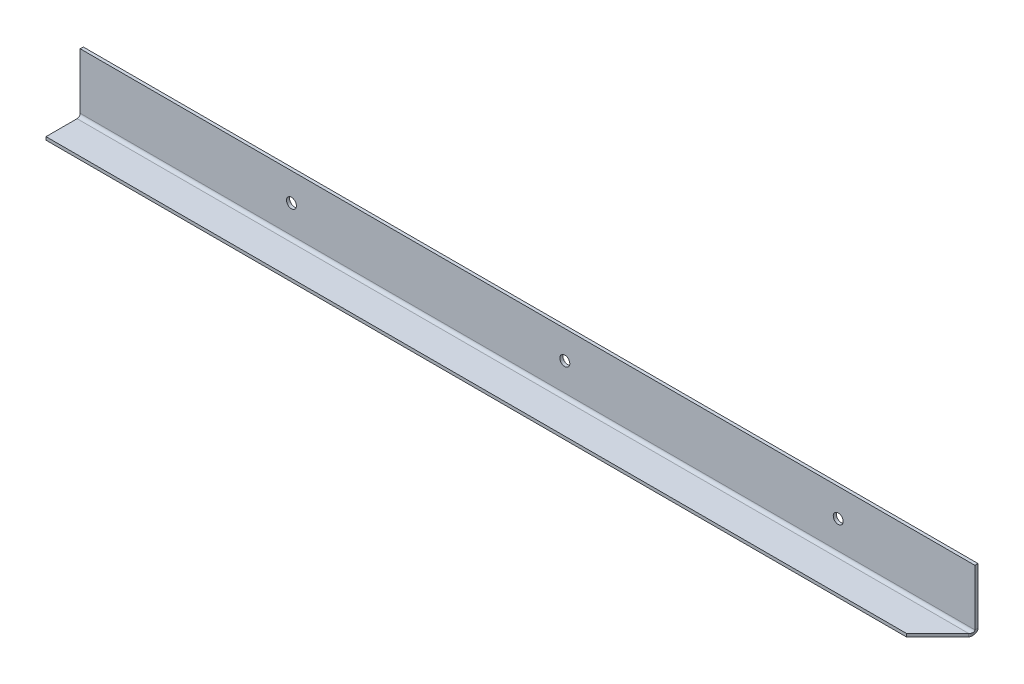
ISO-10303-21;
HEADER;
FILE_DESCRIPTION(('STEP AP214'),'2;1');
FILE_NAME('part.step','',(''),(''),'','','');
FILE_SCHEMA(('AUTOMOTIVE_DESIGN { 1 0 10303 214 1 1 1 1 }'));
ENDSEC;
DATA;
#1=APPLICATION_CONTEXT('core data for automotive mechanical design processes');
#2=APPLICATION_PROTOCOL_DEFINITION('international standard','automotive_design',2000,#1);
#3=PRODUCT_CONTEXT('',#1,'mechanical');
#4=PRODUCT('Part','Part','',(#3));
#5=PRODUCT_RELATED_PRODUCT_CATEGORY('part','',(#4));
#6=PRODUCT_DEFINITION_FORMATION('','',#4);
#7=PRODUCT_DEFINITION_CONTEXT('part definition',#1,'design');
#8=PRODUCT_DEFINITION('design','',#6,#7);
#9=PRODUCT_DEFINITION_SHAPE('','',#8);
#10=(LENGTH_UNIT() NAMED_UNIT(*) SI_UNIT(.MILLI.,.METRE.));
#11=(NAMED_UNIT(*) PLANE_ANGLE_UNIT() SI_UNIT($,.RADIAN.));
#12=(NAMED_UNIT(*) SI_UNIT($,.STERADIAN.) SOLID_ANGLE_UNIT());
#13=UNCERTAINTY_MEASURE_WITH_UNIT(LENGTH_MEASURE(1.E-05),#10,'distance_accuracy_value','');
#14=(GEOMETRIC_REPRESENTATION_CONTEXT(3) GLOBAL_UNCERTAINTY_ASSIGNED_CONTEXT((#13)) GLOBAL_UNIT_ASSIGNED_CONTEXT((#10,
#11,#12)) REPRESENTATION_CONTEXT('',''));
#15=CARTESIAN_POINT('',(0.,0.,0.));
#16=DIRECTION('',(0.,0.,1.));
#17=DIRECTION('',(1.,0.,0.));
#18=AXIS2_PLACEMENT_3D('',#15,#16,#17);
#19=CARTESIAN_POINT('',(495.814044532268,1.5875,0.));
#20=DIRECTION('',(0.,-1.,0.));
#21=DIRECTION('',(0.,0.,-1.));
#22=AXIS2_PLACEMENT_3D('',#19,#20,#21);
#23=PLANE('',#22);
#24=DIRECTION('',(0.707106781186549,0.,-0.707106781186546));
#25=VECTOR('',#24,1.);
#26=CARTESIAN_POINT('',(477.300772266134,1.5875,-18.5132722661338));
#27=LINE('',#26,#25);
#28=CARTESIAN_POINT('',(439.7375,1.58749999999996,19.05));
#29=VERTEX_POINT('',#28);
#30=CARTESIAN_POINT('',(455.6125,1.5875,3.175));
#31=VERTEX_POINT('',#30);
#32=EDGE_CURVE('E129',#29,#31,#27,.T.);
#33=ORIENTED_EDGE('',*,*,#32,.T.);
#34=DIRECTION('',(-1.,0.,0.));
#35=VECTOR('',#34,1.);
#36=CARTESIAN_POINT('',(495.814044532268,1.5875,3.175));
#37=LINE('',#36,#35);
#38=CARTESIAN_POINT('',(0.,1.5875,3.175));
#39=VERTEX_POINT('',#38);
#40=EDGE_CURVE('E74',#31,#39,#37,.T.);
#41=ORIENTED_EDGE('',*,*,#40,.T.);
#42=DIRECTION('',(0.,0.,1.));
#43=VECTOR('',#42,1.);
#44=CARTESIAN_POINT('',(0.,1.5875,0.));
#45=LINE('',#44,#43);
#46=CARTESIAN_POINT('',(0.,1.5875,19.05));
#47=VERTEX_POINT('',#46);
#48=EDGE_CURVE('E138',#39,#47,#45,.T.);
#49=ORIENTED_EDGE('',*,*,#48,.T.);
#50=DIRECTION('',(-1.,0.,0.));
#51=VECTOR('',#50,1.);
#52=CARTESIAN_POINT('',(495.814044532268,1.5875,19.05));
#53=LINE('',#52,#51);
#54=EDGE_CURVE('E160',#29,#47,#53,.T.);
#55=ORIENTED_EDGE('',*,*,#54,.F.);
#56=EDGE_LOOP('',(#33,#41,#49,#55));
#57=FACE_BOUND('',#56,.T.);
#58=ADVANCED_FACE('F48',(#57),#23,.F.);
#59=CARTESIAN_POINT('',(495.814044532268,0.,19.05));
#60=DIRECTION('',(0.,0.,1.));
#61=DIRECTION('',(1.,0.,0.));
#62=AXIS2_PLACEMENT_3D('',#59,#60,#61);
#63=PLANE('',#62);
#64=DIRECTION('',(-1.,0.,0.));
#65=VECTOR('',#64,1.);
#66=CARTESIAN_POINT('',(495.814044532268,0.,19.05));
#67=LINE('',#66,#65);
#68=CARTESIAN_POINT('',(439.7375,0.,19.05));
#69=VERTEX_POINT('',#68);
#70=CARTESIAN_POINT('',(0.,0.,19.05));
#71=VERTEX_POINT('',#70);
#72=EDGE_CURVE('E155',#69,#71,#67,.T.);
#73=ORIENTED_EDGE('',*,*,#72,.F.);
#74=DIRECTION('',(0.,1.,0.));
#75=VECTOR('',#74,1.);
#76=CARTESIAN_POINT('',(439.7375,1.58749999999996,19.05));
#77=LINE('',#76,#75);
#78=EDGE_CURVE('E124',#29,#69,#77,.F.);
#79=ORIENTED_EDGE('',*,*,#78,.F.);
#80=ORIENTED_EDGE('',*,*,#54,.T.);
#81=DIRECTION('',(0.,1.,0.));
#82=VECTOR('',#81,1.);
#83=CARTESIAN_POINT('',(0.,0.,19.05));
#84=LINE('',#83,#82);
#85=EDGE_CURVE('E210',#71,#47,#84,.T.);
#86=ORIENTED_EDGE('',*,*,#85,.F.);
#87=EDGE_LOOP('',(#73,#79,#80,#86));
#88=FACE_BOUND('',#87,.T.);
#89=ADVANCED_FACE('F268',(#88),#63,.T.);
#90=CARTESIAN_POINT('',(495.814044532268,0.,0.));
#91=DIRECTION('',(0.,-1.,0.));
#92=DIRECTION('',(0.,0.,-1.));
#93=AXIS2_PLACEMENT_3D('',#90,#91,#92);
#94=PLANE('',#93);
#95=DIRECTION('',(-1.,0.,0.));
#96=VECTOR('',#95,1.);
#97=CARTESIAN_POINT('',(495.814044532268,0.,3.175));
#98=LINE('',#97,#96);
#99=CARTESIAN_POINT('',(455.6125,0.,3.175));
#100=VERTEX_POINT('',#99);
#101=CARTESIAN_POINT('',(0.,0.,3.175));
#102=VERTEX_POINT('',#101);
#103=EDGE_CURVE('E144',#100,#102,#98,.T.);
#104=ORIENTED_EDGE('',*,*,#103,.F.);
#105=DIRECTION('',(0.707106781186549,0.,-0.707106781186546));
#106=VECTOR('',#105,1.);
#107=CARTESIAN_POINT('',(477.300772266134,0.,-18.5132722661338));
#108=LINE('',#107,#106);
#109=EDGE_CURVE('E118',#69,#100,#108,.T.);
#110=ORIENTED_EDGE('',*,*,#109,.F.);
#111=ORIENTED_EDGE('',*,*,#72,.T.);
#112=DIRECTION('',(0.,0.,1.));
#113=VECTOR('',#112,1.);
#114=CARTESIAN_POINT('',(0.,0.,0.));
#115=LINE('',#114,#113);
#116=EDGE_CURVE('E152',#102,#71,#115,.T.);
#117=ORIENTED_EDGE('',*,*,#116,.F.);
#118=EDGE_LOOP('',(#104,#110,#111,#117));
#119=FACE_BOUND('',#118,.T.);
#120=ADVANCED_FACE('F150',(#119),#94,.T.);
#121=CARTESIAN_POINT('',(495.814044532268,3.175,3.175));
#122=DIRECTION('',(-1.,0.,0.));
#123=DIRECTION('',(0.,0.,1.));
#124=AXIS2_PLACEMENT_3D('',#121,#122,#123);
#125=CYLINDRICAL_SURFACE('',#124,3.175);
#126=DIRECTION('',(-1.,0.,0.));
#127=VECTOR('',#126,1.);
#128=CARTESIAN_POINT('',(495.814044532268,3.175,0.));
#129=LINE('',#128,#127);
#130=CARTESIAN_POINT('',(457.2,3.175,0.));
#131=VERTEX_POINT('',#130);
#132=CARTESIAN_POINT('',(0.,3.175,0.));
#133=VERTEX_POINT('',#132);
#134=EDGE_CURVE('E146',#131,#133,#129,.T.);
#135=ORIENTED_EDGE('',*,*,#134,.F.);
#136=CARTESIAN_POINT('',(455.6125,3.175,3.175));
#137=DIRECTION('',(-0.894427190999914,0.,-0.447213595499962));
#138=DIRECTION('',(-0.447213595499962,0.,0.894427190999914));
#139=AXIS2_PLACEMENT_3D('',#136,#137,#138);
#140=ELLIPSE('',#139,3.54975791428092,3.175);
#141=EDGE_CURVE('E134',#100,#131,#140,.F.);
#142=ORIENTED_EDGE('',*,*,#141,.F.);
#143=ORIENTED_EDGE('',*,*,#103,.T.);
#144=CARTESIAN_POINT('',(0.,3.175,3.175));
#145=DIRECTION('',(1.,0.,0.));
#146=DIRECTION('',(0.,0.,-1.));
#147=AXIS2_PLACEMENT_3D('',#144,#145,#146);
#148=CIRCLE('',#147,3.175);
#149=EDGE_CURVE('E216',#133,#102,#148,.F.);
#150=ORIENTED_EDGE('',*,*,#149,.F.);
#151=EDGE_LOOP('',(#135,#142,#143,#150));
#152=FACE_BOUND('',#151,.T.);
#153=ADVANCED_FACE('F142',(#152),#125,.T.);
#154=CARTESIAN_POINT('',(495.814044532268,0.,0.));
#155=DIRECTION('',(0.,0.,-1.));
#156=DIRECTION('',(-1.,0.,0.));
#157=AXIS2_PLACEMENT_3D('',#154,#155,#156);
#158=PLANE('',#157);
#159=CARTESIAN_POINT('',(387.35,17.4625,0.));
#160=DIRECTION('',(0.,0.,-1.));
#161=DIRECTION('',(-1.,0.,0.));
#162=AXIS2_PLACEMENT_3D('',#159,#160,#161);
#163=CIRCLE('',#162,2.54000000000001);
#164=CARTESIAN_POINT('',(384.81,17.4625,0.));
#165=VERTEX_POINT('',#164);
#166=EDGE_CURVE('E174',#165,#165,#163,.T.);
#167=ORIENTED_EDGE('',*,*,#166,.F.);
#168=EDGE_LOOP('',(#167));
#169=FACE_BOUND('',#168,.T.);
#170=CARTESIAN_POINT('',(247.65,17.4625,0.));
#171=DIRECTION('',(0.,0.,-1.));
#172=DIRECTION('',(-1.,0.,0.));
#173=AXIS2_PLACEMENT_3D('',#170,#171,#172);
#174=CIRCLE('',#173,2.53999999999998);
#175=CARTESIAN_POINT('',(245.11,17.4625,0.));
#176=VERTEX_POINT('',#175);
#177=EDGE_CURVE('E456',#176,#176,#174,.T.);
#178=ORIENTED_EDGE('',*,*,#177,.F.);
#179=EDGE_LOOP('',(#178));
#180=FACE_BOUND('',#179,.T.);
#181=CARTESIAN_POINT('',(107.95,17.4625,0.));
#182=DIRECTION('',(0.,0.,-1.));
#183=DIRECTION('',(-1.,0.,0.));
#184=AXIS2_PLACEMENT_3D('',#181,#182,#183);
#185=CIRCLE('',#184,2.54);
#186=CARTESIAN_POINT('',(105.41,17.4625,0.));
#187=VERTEX_POINT('',#186);
#188=EDGE_CURVE('E461',#187,#187,#185,.T.);
#189=ORIENTED_EDGE('',*,*,#188,.F.);
#190=EDGE_LOOP('',(#189));
#191=FACE_BOUND('',#190,.T.);
#192=DIRECTION('',(-1.,0.,0.));
#193=VECTOR('',#192,1.);
#194=CARTESIAN_POINT('',(495.814044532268,31.75,0.));
#195=LINE('',#194,#193);
#196=CARTESIAN_POINT('',(457.2,31.75,0.));
#197=VERTEX_POINT('',#196);
#198=CARTESIAN_POINT('',(0.,31.75,0.));
#199=VERTEX_POINT('',#198);
#200=EDGE_CURVE('E162',#197,#199,#195,.T.);
#201=ORIENTED_EDGE('',*,*,#200,.F.);
#202=DIRECTION('',(0.,1.,0.));
#203=VECTOR('',#202,1.);
#204=CARTESIAN_POINT('',(457.2,0.,0.));
#205=LINE('',#204,#203);
#206=EDGE_CURVE('E192',#131,#197,#205,.T.);
#207=ORIENTED_EDGE('',*,*,#206,.F.);
#208=ORIENTED_EDGE('',*,*,#134,.T.);
#209=DIRECTION('',(0.,-1.,0.));
#210=VECTOR('',#209,1.);
#211=CARTESIAN_POINT('',(0.,0.,0.));
#212=LINE('',#211,#210);
#213=EDGE_CURVE('E219',#199,#133,#212,.T.);
#214=ORIENTED_EDGE('',*,*,#213,.F.);
#215=EDGE_LOOP('',(#201,#207,#208,#214));
#216=FACE_BOUND('',#215,.T.);
#217=ADVANCED_FACE('F252',(#169,#180,#191,#216),#158,.T.);
#218=CARTESIAN_POINT('',(495.814044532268,31.75,1.5875));
#219=DIRECTION('',(0.,1.,0.));
#220=DIRECTION('',(0.,0.,1.));
#221=AXIS2_PLACEMENT_3D('',#218,#219,#220);
#222=PLANE('',#221);
#223=DIRECTION('',(-1.,0.,0.));
#224=VECTOR('',#223,1.);
#225=CARTESIAN_POINT('',(495.814044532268,31.75,1.5875));
#226=LINE('',#225,#224);
#227=CARTESIAN_POINT('',(457.2,31.75,1.5875));
#228=VERTEX_POINT('',#227);
#229=CARTESIAN_POINT('',(0.,31.75,1.5875));
#230=VERTEX_POINT('',#229);
#231=EDGE_CURVE('E240',#228,#230,#226,.T.);
#232=ORIENTED_EDGE('',*,*,#231,.F.);
#233=DIRECTION('',(0.,0.,1.));
#234=VECTOR('',#233,1.);
#235=CARTESIAN_POINT('',(457.2,31.75,1.5875));
#236=LINE('',#235,#234);
#237=EDGE_CURVE('E198',#228,#197,#236,.F.);
#238=ORIENTED_EDGE('',*,*,#237,.T.);
#239=ORIENTED_EDGE('',*,*,#200,.T.);
#240=DIRECTION('',(0.,0.,-1.));
#241=VECTOR('',#240,1.);
#242=CARTESIAN_POINT('',(0.,31.75,1.5875));
#243=LINE('',#242,#241);
#244=EDGE_CURVE('E223',#230,#199,#243,.T.);
#245=ORIENTED_EDGE('',*,*,#244,.F.);
#246=EDGE_LOOP('',(#232,#238,#239,#245));
#247=FACE_BOUND('',#246,.T.);
#248=ADVANCED_FACE('F249',(#247),#222,.T.);
#249=CARTESIAN_POINT('',(495.814044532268,0.,1.5875));
#250=DIRECTION('',(0.,0.,-1.));
#251=DIRECTION('',(-1.,0.,0.));
#252=AXIS2_PLACEMENT_3D('',#249,#250,#251);
#253=PLANE('',#252);
#254=CARTESIAN_POINT('',(387.35,17.4625,1.5875));
#255=DIRECTION('',(0.,0.,-1.));
#256=DIRECTION('',(-1.,0.,0.));
#257=AXIS2_PLACEMENT_3D('',#254,#255,#256);
#258=CIRCLE('',#257,2.54000000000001);
#259=CARTESIAN_POINT('',(384.81,17.4625,1.5875));
#260=VERTEX_POINT('',#259);
#261=EDGE_CURVE('E52',#260,#260,#258,.T.);
#262=ORIENTED_EDGE('',*,*,#261,.T.);
#263=EDGE_LOOP('',(#262));
#264=FACE_BOUND('',#263,.T.);
#265=CARTESIAN_POINT('',(247.65,17.4625,1.5875));
#266=DIRECTION('',(0.,0.,-1.));
#267=DIRECTION('',(-1.,0.,0.));
#268=AXIS2_PLACEMENT_3D('',#265,#266,#267);
#269=CIRCLE('',#268,2.53999999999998);
#270=CARTESIAN_POINT('',(245.11,17.4625,1.5875));
#271=VERTEX_POINT('',#270);
#272=EDGE_CURVE('E173',#271,#271,#269,.T.);
#273=ORIENTED_EDGE('',*,*,#272,.T.);
#274=EDGE_LOOP('',(#273));
#275=FACE_BOUND('',#274,.T.);
#276=CARTESIAN_POINT('',(107.95,17.4625,1.5875));
#277=DIRECTION('',(0.,0.,-1.));
#278=DIRECTION('',(-1.,0.,0.));
#279=AXIS2_PLACEMENT_3D('',#276,#277,#278);
#280=CIRCLE('',#279,2.54);
#281=CARTESIAN_POINT('',(105.41,17.4625,1.5875));
#282=VERTEX_POINT('',#281);
#283=EDGE_CURVE('E170',#282,#282,#280,.T.);
#284=ORIENTED_EDGE('',*,*,#283,.T.);
#285=EDGE_LOOP('',(#284));
#286=FACE_BOUND('',#285,.T.);
#287=DIRECTION('',(0.,1.,0.));
#288=VECTOR('',#287,1.);
#289=CARTESIAN_POINT('',(457.2,0.,1.5875));
#290=LINE('',#289,#288);
#291=CARTESIAN_POINT('',(457.2,3.175,1.5875));
#292=VERTEX_POINT('',#291);
#293=EDGE_CURVE('E66',#292,#228,#290,.T.);
#294=ORIENTED_EDGE('',*,*,#293,.T.);
#295=ORIENTED_EDGE('',*,*,#231,.T.);
#296=DIRECTION('',(0.,1.,0.));
#297=VECTOR('',#296,1.);
#298=CARTESIAN_POINT('',(0.,0.,1.5875));
#299=LINE('',#298,#297);
#300=CARTESIAN_POINT('',(0.,3.175,1.5875));
#301=VERTEX_POINT('',#300);
#302=EDGE_CURVE('E227',#230,#301,#299,.F.);
#303=ORIENTED_EDGE('',*,*,#302,.T.);
#304=DIRECTION('',(-1.,0.,0.));
#305=VECTOR('',#304,1.);
#306=CARTESIAN_POINT('',(495.814044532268,3.175,1.5875));
#307=LINE('',#306,#305);
#308=EDGE_CURVE('E237',#292,#301,#307,.T.);
#309=ORIENTED_EDGE('',*,*,#308,.F.);
#310=EDGE_LOOP('',(#294,#295,#303,#309));
#311=FACE_BOUND('',#310,.T.);
#312=ADVANCED_FACE('F259',(#264,#275,#286,#311),#253,.F.);
#313=CARTESIAN_POINT('',(495.814044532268,3.175,3.175));
#314=DIRECTION('',(-1.,0.,0.));
#315=DIRECTION('',(0.,0.,1.));
#316=AXIS2_PLACEMENT_3D('',#313,#314,#315);
#317=CYLINDRICAL_SURFACE('',#316,1.5875);
#318=CARTESIAN_POINT('',(455.6125,3.175,3.175));
#319=DIRECTION('',(-0.707106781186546,0.,-0.707106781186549));
#320=DIRECTION('',(-0.707106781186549,0.,0.707106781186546));
#321=AXIS2_PLACEMENT_3D('',#318,#319,#320);
#322=ELLIPSE('',#321,2.24506403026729,1.5875);
#323=EDGE_CURVE('E136',#31,#292,#322,.F.);
#324=ORIENTED_EDGE('',*,*,#323,.T.);
#325=ORIENTED_EDGE('',*,*,#308,.T.);
#326=CARTESIAN_POINT('',(0.,3.175,3.175));
#327=DIRECTION('',(1.,0.,0.));
#328=DIRECTION('',(0.,0.,-1.));
#329=AXIS2_PLACEMENT_3D('',#326,#327,#328);
#330=CIRCLE('',#329,1.5875);
#331=EDGE_CURVE('E231',#301,#39,#330,.F.);
#332=ORIENTED_EDGE('',*,*,#331,.T.);
#333=ORIENTED_EDGE('',*,*,#40,.F.);
#334=EDGE_LOOP('',(#324,#325,#332,#333));
#335=FACE_BOUND('',#334,.T.);
#336=ADVANCED_FACE('F262',(#335),#317,.F.);
#337=CARTESIAN_POINT('',(0.,3.175,0.));
#338=DIRECTION('',(-1.,0.,0.));
#339=DIRECTION('',(0.,0.,1.));
#340=AXIS2_PLACEMENT_3D('',#337,#338,#339);
#341=PLANE('',#340);
#342=DIRECTION('',(0.,0.,1.));
#343=VECTOR('',#342,1.);
#344=CARTESIAN_POINT('',(0.,3.175,0.));
#345=LINE('',#344,#343);
#346=EDGE_CURVE('E11',#133,#301,#345,.T.);
#347=ORIENTED_EDGE('',*,*,#346,.F.);
#348=ORIENTED_EDGE('',*,*,#149,.T.);
#349=DIRECTION('',(0.,-1.,0.));
#350=VECTOR('',#349,1.);
#351=CARTESIAN_POINT('',(0.,1.5875,3.175));
#352=LINE('',#351,#350);
#353=EDGE_CURVE('E58',#39,#102,#352,.T.);
#354=ORIENTED_EDGE('',*,*,#353,.F.);
#355=ORIENTED_EDGE('',*,*,#331,.F.);
#356=EDGE_LOOP('',(#347,#348,#354,#355));
#357=FACE_BOUND('',#356,.T.);
#358=ADVANCED_FACE('F50',(#357),#341,.T.);
#359=CARTESIAN_POINT('',(0.,1.5875,3.175));
#360=DIRECTION('',(-1.,0.,0.));
#361=DIRECTION('',(0.,0.,1.));
#362=AXIS2_PLACEMENT_3D('',#359,#360,#361);
#363=PLANE('',#362);
#364=ORIENTED_EDGE('',*,*,#213,.T.);
#365=ORIENTED_EDGE('',*,*,#346,.T.);
#366=ORIENTED_EDGE('',*,*,#302,.F.);
#367=ORIENTED_EDGE('',*,*,#244,.T.);
#368=EDGE_LOOP('',(#364,#365,#366,#367));
#369=FACE_BOUND('',#368,.T.);
#370=ADVANCED_FACE('F256',(#369),#363,.T.);
#371=CARTESIAN_POINT('',(0.,3.175,3.175));
#372=DIRECTION('',(1.,0.,0.));
#373=DIRECTION('',(0.,0.,-1.));
#374=AXIS2_PLACEMENT_3D('',#371,#372,#373);
#375=PLANE('',#374);
#376=ORIENTED_EDGE('',*,*,#48,.F.);
#377=ORIENTED_EDGE('',*,*,#353,.T.);
#378=ORIENTED_EDGE('',*,*,#116,.T.);
#379=ORIENTED_EDGE('',*,*,#85,.T.);
#380=EDGE_LOOP('',(#376,#377,#378,#379));
#381=FACE_BOUND('',#380,.T.);
#382=ADVANCED_FACE('F264',(#381),#375,.F.);
#383=CARTESIAN_POINT('',(477.300772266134,1.5875,-18.5132722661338));
#384=DIRECTION('',(-0.707106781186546,0.,-0.707106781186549));
#385=DIRECTION('',(0.707106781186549,0.,-0.707106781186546));
#386=AXIS2_PLACEMENT_3D('',#383,#384,#385);
#387=PLANE('',#386);
#388=DIRECTION('',(0.,1.,0.));
#389=VECTOR('',#388,1.);
#390=CARTESIAN_POINT('',(455.6125,1.5875,3.175));
#391=LINE('',#390,#389);
#392=EDGE_CURVE('E121',#31,#100,#391,.F.);
#393=ORIENTED_EDGE('',*,*,#392,.F.);
#394=ORIENTED_EDGE('',*,*,#32,.F.);
#395=ORIENTED_EDGE('',*,*,#78,.T.);
#396=ORIENTED_EDGE('',*,*,#109,.T.);
#397=EDGE_LOOP('',(#393,#394,#395,#396));
#398=FACE_BOUND('',#397,.T.);
#399=ADVANCED_FACE('F120',(#398),#387,.F.);
#400=CARTESIAN_POINT('',(457.2,0.,1.5875));
#401=DIRECTION('',(-1.,0.,0.));
#402=DIRECTION('',(0.,1.,0.));
#403=AXIS2_PLACEMENT_3D('',#400,#401,#402);
#404=PLANE('',#403);
#405=ORIENTED_EDGE('',*,*,#237,.F.);
#406=ORIENTED_EDGE('',*,*,#293,.F.);
#407=DIRECTION('',(0.,0.,1.));
#408=VECTOR('',#407,1.);
#409=CARTESIAN_POINT('',(457.2,3.175,1.5875));
#410=LINE('',#409,#408);
#411=EDGE_CURVE('E195',#292,#131,#410,.F.);
#412=ORIENTED_EDGE('',*,*,#411,.T.);
#413=ORIENTED_EDGE('',*,*,#206,.T.);
#414=EDGE_LOOP('',(#405,#406,#412,#413));
#415=FACE_BOUND('',#414,.T.);
#416=ADVANCED_FACE('F366',(#415),#404,.F.);
#417=CARTESIAN_POINT('',(454.025,3.175,6.35));
#418=CARTESIAN_POINT('',(454.025,3.175,5.82083333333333));
#419=CARTESIAN_POINT('',(454.025,3.175,5.29166666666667));
#420=CARTESIAN_POINT('',(454.025,3.175,4.7625));
#421=CARTESIAN_POINT('',(454.025,-3.175,6.35));
#422=CARTESIAN_POINT('',(454.025,-2.11666666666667,5.82083333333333));
#423=CARTESIAN_POINT('',(454.025,-1.05833333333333,5.29166666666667));
#424=CARTESIAN_POINT('',(454.025,0.,4.7625));
#425=CARTESIAN_POINT('',(457.2,-3.175,0.));
#426=CARTESIAN_POINT('',(457.2,-2.11666666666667,0.529166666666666));
#427=CARTESIAN_POINT('',(457.2,-1.05833333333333,1.05833333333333));
#428=CARTESIAN_POINT('',(457.2,0.,1.5875));
#429=CARTESIAN_POINT('',(457.2,3.175,0.));
#430=CARTESIAN_POINT('',(457.2,3.175,0.529166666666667));
#431=CARTESIAN_POINT('',(457.2,3.175,1.05833333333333));
#432=CARTESIAN_POINT('',(457.2,3.175,1.5875));
#433=CARTESIAN_POINT('',(457.2,9.525,0.));
#434=CARTESIAN_POINT('',(457.2,8.46666666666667,0.529166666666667));
#435=CARTESIAN_POINT('',(457.2,7.40833333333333,1.05833333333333));
#436=CARTESIAN_POINT('',(457.2,6.35,1.5875));
#437=CARTESIAN_POINT('',(454.025,9.525,6.35));
#438=CARTESIAN_POINT('',(454.025,8.46666666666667,5.82083333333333));
#439=CARTESIAN_POINT('',(454.025,7.40833333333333,5.29166666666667));
#440=CARTESIAN_POINT('',(454.025,6.35,4.7625));
#441=CARTESIAN_POINT('',(454.025,3.175,6.35));
#442=CARTESIAN_POINT('',(454.025,3.175,5.82083333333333));
#443=CARTESIAN_POINT('',(454.025,3.175,5.29166666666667));
#444=CARTESIAN_POINT('',(454.025,3.175,4.7625));
#445=(BOUNDED_SURFACE() B_SPLINE_SURFACE(3,3,((#417,#418,#419,#420),(#421,#422,#423,#424),(#425,
#426,#427,#428),(#429,#430,#431,#432),(#433,#434,#435,#436),(#437,#438,#439,#440),(#441,#442,
#443,#444)),.UNSPECIFIED.,.T.,.F.,.F.) B_SPLINE_SURFACE_WITH_KNOTS((4,3,4),(4,4),(0.,0.5,1.),
(0.,1.),.UNSPECIFIED.) GEOMETRIC_REPRESENTATION_ITEM() RATIONAL_B_SPLINE_SURFACE(((1.,1.,1.,1.),
(0.333333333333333,0.333333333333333,0.333333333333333,0.333333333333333),(0.333333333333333,
0.333333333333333,0.333333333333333,0.333333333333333),(1.,1.,1.,1.),(0.333333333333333,
0.333333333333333,0.333333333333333,0.333333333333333),(0.333333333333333,0.333333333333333,
0.333333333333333,0.333333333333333),(1.,1.,1.,1.))) REPRESENTATION_ITEM('') SURFACE());
#446=ORIENTED_EDGE('',*,*,#411,.F.);
#447=ORIENTED_EDGE('',*,*,#323,.F.);
#448=ORIENTED_EDGE('',*,*,#392,.T.);
#449=ORIENTED_EDGE('',*,*,#141,.T.);
#450=EDGE_LOOP('',(#446,#447,#448,#449));
#451=FACE_BOUND('',#450,.T.);
#452=ADVANCED_FACE('F133',(#451),#445,.T.);
#453=CARTESIAN_POINT('',(107.95,17.4625,19.05));
#454=DIRECTION('',(0.,0.,-1.));
#455=DIRECTION('',(-1.,0.,0.));
#456=AXIS2_PLACEMENT_3D('',#453,#454,#455);
#457=CYLINDRICAL_SURFACE('',#456,2.54);
#458=CARTESIAN_POINT('',(105.41,17.4625,0.));
#459=CARTESIAN_POINT('',(105.41,17.4625,0.016536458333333));
#460=CARTESIAN_POINT('',(105.41,17.4625,0.0330729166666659));
#461=CARTESIAN_POINT('',(105.41,17.4625,0.066145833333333));
#462=CARTESIAN_POINT('',(105.41,17.4625,0.0826822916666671));
#463=CARTESIAN_POINT('',(105.41,17.4625,0.115755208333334));
#464=CARTESIAN_POINT('',(105.41,17.4625,0.132291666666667));
#465=CARTESIAN_POINT('',(105.41,17.4625,0.165364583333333));
#466=CARTESIAN_POINT('',(105.41,17.4625,0.181901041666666));
#467=CARTESIAN_POINT('',(105.41,17.4625,0.214973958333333));
#468=CARTESIAN_POINT('',(105.41,17.4625,0.231510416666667));
#469=CARTESIAN_POINT('',(105.41,17.4625,0.264583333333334));
#470=CARTESIAN_POINT('',(105.41,17.4625,0.281119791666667));
#471=CARTESIAN_POINT('',(105.41,17.4625,0.314192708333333));
#472=CARTESIAN_POINT('',(105.41,17.4625,0.330729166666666));
#473=CARTESIAN_POINT('',(105.41,17.4625,0.363802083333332));
#474=CARTESIAN_POINT('',(105.41,17.4625,0.380338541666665));
#475=CARTESIAN_POINT('',(105.41,17.4625,0.413411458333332));
#476=CARTESIAN_POINT('',(105.41,17.4625,0.429947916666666));
#477=CARTESIAN_POINT('',(105.41,17.4625,0.463020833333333));
#478=CARTESIAN_POINT('',(105.41,17.4625,0.479557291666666));
#479=CARTESIAN_POINT('',(105.41,17.4625,0.512630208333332));
#480=CARTESIAN_POINT('',(105.41,17.4625,0.529166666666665));
#481=CARTESIAN_POINT('',(105.41,17.4625,0.562239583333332));
#482=CARTESIAN_POINT('',(105.41,17.4625,0.578776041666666));
#483=CARTESIAN_POINT('',(105.41,17.4625,0.611848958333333));
#484=CARTESIAN_POINT('',(105.41,17.4625,0.628385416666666));
#485=CARTESIAN_POINT('',(105.41,17.4625,0.661458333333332));
#486=CARTESIAN_POINT('',(105.41,17.4625,0.677994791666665));
#487=CARTESIAN_POINT('',(105.41,17.4625,0.711067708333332));
#488=CARTESIAN_POINT('',(105.41,17.4625,0.727604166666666));
#489=CARTESIAN_POINT('',(105.41,17.4625,0.760677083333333));
#490=CARTESIAN_POINT('',(105.41,17.4625,0.777213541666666));
#491=CARTESIAN_POINT('',(105.41,17.4625,0.810286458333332));
#492=CARTESIAN_POINT('',(105.41,17.4625,0.826822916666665));
#493=CARTESIAN_POINT('',(105.41,17.4625,0.859895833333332));
#494=CARTESIAN_POINT('',(105.41,17.4625,0.876432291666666));
#495=CARTESIAN_POINT('',(105.41,17.4625,0.909505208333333));
#496=CARTESIAN_POINT('',(105.41,17.4625,0.926041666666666));
#497=CARTESIAN_POINT('',(105.41,17.4625,0.959114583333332));
#498=CARTESIAN_POINT('',(105.41,17.4625,0.975651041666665));
#499=CARTESIAN_POINT('',(105.41,17.4625,1.00872395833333));
#500=CARTESIAN_POINT('',(105.41,17.4625,1.02526041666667));
#501=CARTESIAN_POINT('',(105.41,17.4625,1.05833333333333));
#502=CARTESIAN_POINT('',(105.41,17.4625,1.07486979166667));
#503=CARTESIAN_POINT('',(105.41,17.4625,1.10794270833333));
#504=CARTESIAN_POINT('',(105.41,17.4625,1.12447916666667));
#505=CARTESIAN_POINT('',(105.41,17.4625,1.15755208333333));
#506=CARTESIAN_POINT('',(105.41,17.4625,1.17408854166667));
#507=CARTESIAN_POINT('',(105.41,17.4625,1.20716145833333));
#508=CARTESIAN_POINT('',(105.41,17.4625,1.22369791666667));
#509=CARTESIAN_POINT('',(105.41,17.4625,1.25677083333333));
#510=CARTESIAN_POINT('',(105.41,17.4625,1.27330729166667));
#511=CARTESIAN_POINT('',(105.41,17.4625,1.30638020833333));
#512=CARTESIAN_POINT('',(105.41,17.4625,1.32291666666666));
#513=CARTESIAN_POINT('',(105.41,17.4625,1.35598958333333));
#514=CARTESIAN_POINT('',(105.41,17.4625,1.37252604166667));
#515=CARTESIAN_POINT('',(105.41,17.4625,1.40559895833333));
#516=CARTESIAN_POINT('',(105.41,17.4625,1.42213541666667));
#517=CARTESIAN_POINT('',(105.41,17.4625,1.45520833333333));
#518=CARTESIAN_POINT('',(105.41,17.4625,1.47174479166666));
#519=CARTESIAN_POINT('',(105.41,17.4625,1.50481770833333));
#520=CARTESIAN_POINT('',(105.41,17.4625,1.52135416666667));
#521=CARTESIAN_POINT('',(105.41,17.4625,1.55442708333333));
#522=CARTESIAN_POINT('',(105.41,17.4625,1.57096354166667));
#523=CARTESIAN_POINT('',(105.41,17.4625,1.5875));
#524=B_SPLINE_CURVE_WITH_KNOTS('',3,(#458,#459,#460,#461,#462,#463,#464,#465,#466,#467,#468,
#469,#470,#471,#472,#473,#474,#475,#476,#477,#478,#479,#480,#481,#482,#483,#484,#485,#486,#487,
#488,#489,#490,#491,#492,#493,#494,#495,#496,#497,#498,#499,#500,#501,#502,#503,#504,#505,#506,
#507,#508,#509,#510,#511,#512,#513,#514,#515,#516,#517,#518,#519,#520,#521,#522,#523),
.UNSPECIFIED.,.F.,.F.,(4,2,2,2,2,2,2,2,2,2,2,2,2,2,2,2,2,2,2,2,2,2,2,2,2,2,2,2,2,2,2,2,4),(0.,
0.0496093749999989,0.0992187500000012,0.148828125,0.198437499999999,0.248046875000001,
0.29765625,0.347265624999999,0.396874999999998,0.446484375,0.496093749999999,0.545703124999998,
0.5953125,0.644921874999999,0.694531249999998,0.744140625,0.793749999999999,0.843359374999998,
0.892968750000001,0.942578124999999,0.992187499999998,1.041796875,1.09140625,1.141015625,
1.190625,1.240234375,1.28984375,1.339453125,1.3890625,1.438671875,1.48828125,1.537890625,
1.5875),.UNSPECIFIED.);
#525=EDGE_CURVE('BSEAM327',#187,#282,#524,.T.);
#526=ORIENTED_EDGE('',*,*,#188,.T.);
#527=ORIENTED_EDGE('',*,*,#283,.F.);
#528=ORIENTED_EDGE('',*,*,#525,.T.);
#529=ORIENTED_EDGE('',*,*,#525,.F.);
#530=EDGE_LOOP('',(#526,#528,#527,#529));
#531=FACE_BOUND('',#530,.T.);
#532=ADVANCED_FACE('F327',(#531),#457,.F.);
#533=CARTESIAN_POINT('',(247.65,17.4625,19.05));
#534=DIRECTION('',(0.,0.,-1.));
#535=DIRECTION('',(-1.,0.,0.));
#536=AXIS2_PLACEMENT_3D('',#533,#534,#535);
#537=CYLINDRICAL_SURFACE('',#536,2.53999999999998);
#538=CARTESIAN_POINT('',(245.11,17.4625,0.));
#539=CARTESIAN_POINT('',(245.11,17.4625,0.016536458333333));
#540=CARTESIAN_POINT('',(245.11,17.4625,0.0330729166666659));
#541=CARTESIAN_POINT('',(245.11,17.4625,0.066145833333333));
#542=CARTESIAN_POINT('',(245.11,17.4625,0.0826822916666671));
#543=CARTESIAN_POINT('',(245.11,17.4625,0.115755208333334));
#544=CARTESIAN_POINT('',(245.11,17.4625,0.132291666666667));
#545=CARTESIAN_POINT('',(245.11,17.4625,0.165364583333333));
#546=CARTESIAN_POINT('',(245.11,17.4625,0.181901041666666));
#547=CARTESIAN_POINT('',(245.11,17.4625,0.214973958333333));
#548=CARTESIAN_POINT('',(245.11,17.4625,0.231510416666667));
#549=CARTESIAN_POINT('',(245.11,17.4625,0.264583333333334));
#550=CARTESIAN_POINT('',(245.11,17.4625,0.281119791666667));
#551=CARTESIAN_POINT('',(245.11,17.4625,0.314192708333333));
#552=CARTESIAN_POINT('',(245.11,17.4625,0.330729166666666));
#553=CARTESIAN_POINT('',(245.11,17.4625,0.363802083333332));
#554=CARTESIAN_POINT('',(245.11,17.4625,0.380338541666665));
#555=CARTESIAN_POINT('',(245.11,17.4625,0.413411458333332));
#556=CARTESIAN_POINT('',(245.11,17.4625,0.429947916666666));
#557=CARTESIAN_POINT('',(245.11,17.4625,0.463020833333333));
#558=CARTESIAN_POINT('',(245.11,17.4625,0.479557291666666));
#559=CARTESIAN_POINT('',(245.11,17.4625,0.512630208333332));
#560=CARTESIAN_POINT('',(245.11,17.4625,0.529166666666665));
#561=CARTESIAN_POINT('',(245.11,17.4625,0.562239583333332));
#562=CARTESIAN_POINT('',(245.11,17.4625,0.578776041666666));
#563=CARTESIAN_POINT('',(245.11,17.4625,0.611848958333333));
#564=CARTESIAN_POINT('',(245.11,17.4625,0.628385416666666));
#565=CARTESIAN_POINT('',(245.11,17.4625,0.661458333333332));
#566=CARTESIAN_POINT('',(245.11,17.4625,0.677994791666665));
#567=CARTESIAN_POINT('',(245.11,17.4625,0.711067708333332));
#568=CARTESIAN_POINT('',(245.11,17.4625,0.727604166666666));
#569=CARTESIAN_POINT('',(245.11,17.4625,0.760677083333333));
#570=CARTESIAN_POINT('',(245.11,17.4625,0.777213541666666));
#571=CARTESIAN_POINT('',(245.11,17.4625,0.810286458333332));
#572=CARTESIAN_POINT('',(245.11,17.4625,0.826822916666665));
#573=CARTESIAN_POINT('',(245.11,17.4625,0.859895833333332));
#574=CARTESIAN_POINT('',(245.11,17.4625,0.876432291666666));
#575=CARTESIAN_POINT('',(245.11,17.4625,0.909505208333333));
#576=CARTESIAN_POINT('',(245.11,17.4625,0.926041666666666));
#577=CARTESIAN_POINT('',(245.11,17.4625,0.959114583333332));
#578=CARTESIAN_POINT('',(245.11,17.4625,0.975651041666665));
#579=CARTESIAN_POINT('',(245.11,17.4625,1.00872395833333));
#580=CARTESIAN_POINT('',(245.11,17.4625,1.02526041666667));
#581=CARTESIAN_POINT('',(245.11,17.4625,1.05833333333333));
#582=CARTESIAN_POINT('',(245.11,17.4625,1.07486979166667));
#583=CARTESIAN_POINT('',(245.11,17.4625,1.10794270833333));
#584=CARTESIAN_POINT('',(245.11,17.4625,1.12447916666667));
#585=CARTESIAN_POINT('',(245.11,17.4625,1.15755208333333));
#586=CARTESIAN_POINT('',(245.11,17.4625,1.17408854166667));
#587=CARTESIAN_POINT('',(245.11,17.4625,1.20716145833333));
#588=CARTESIAN_POINT('',(245.11,17.4625,1.22369791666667));
#589=CARTESIAN_POINT('',(245.11,17.4625,1.25677083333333));
#590=CARTESIAN_POINT('',(245.11,17.4625,1.27330729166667));
#591=CARTESIAN_POINT('',(245.11,17.4625,1.30638020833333));
#592=CARTESIAN_POINT('',(245.11,17.4625,1.32291666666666));
#593=CARTESIAN_POINT('',(245.11,17.4625,1.35598958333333));
#594=CARTESIAN_POINT('',(245.11,17.4625,1.37252604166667));
#595=CARTESIAN_POINT('',(245.11,17.4625,1.40559895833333));
#596=CARTESIAN_POINT('',(245.11,17.4625,1.42213541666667));
#597=CARTESIAN_POINT('',(245.11,17.4625,1.45520833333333));
#598=CARTESIAN_POINT('',(245.11,17.4625,1.47174479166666));
#599=CARTESIAN_POINT('',(245.11,17.4625,1.50481770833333));
#600=CARTESIAN_POINT('',(245.11,17.4625,1.52135416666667));
#601=CARTESIAN_POINT('',(245.11,17.4625,1.55442708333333));
#602=CARTESIAN_POINT('',(245.11,17.4625,1.57096354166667));
#603=CARTESIAN_POINT('',(245.11,17.4625,1.5875));
#604=B_SPLINE_CURVE_WITH_KNOTS('',3,(#538,#539,#540,#541,#542,#543,#544,#545,#546,#547,#548,
#549,#550,#551,#552,#553,#554,#555,#556,#557,#558,#559,#560,#561,#562,#563,#564,#565,#566,#567,
#568,#569,#570,#571,#572,#573,#574,#575,#576,#577,#578,#579,#580,#581,#582,#583,#584,#585,#586,
#587,#588,#589,#590,#591,#592,#593,#594,#595,#596,#597,#598,#599,#600,#601,#602,#603),
.UNSPECIFIED.,.F.,.F.,(4,2,2,2,2,2,2,2,2,2,2,2,2,2,2,2,2,2,2,2,2,2,2,2,2,2,2,2,2,2,2,2,4),(0.,
0.0496093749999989,0.0992187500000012,0.148828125,0.198437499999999,0.248046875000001,
0.29765625,0.347265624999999,0.396874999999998,0.446484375,0.496093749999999,0.545703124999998,
0.5953125,0.644921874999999,0.694531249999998,0.744140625,0.793749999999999,0.843359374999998,
0.892968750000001,0.942578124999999,0.992187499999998,1.041796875,1.09140625,1.141015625,
1.190625,1.240234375,1.28984375,1.339453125,1.3890625,1.438671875,1.48828125,1.537890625,
1.5875),.UNSPECIFIED.);
#605=EDGE_CURVE('BSEAM331',#176,#271,#604,.T.);
#606=ORIENTED_EDGE('',*,*,#177,.T.);
#607=ORIENTED_EDGE('',*,*,#272,.F.);
#608=ORIENTED_EDGE('',*,*,#605,.T.);
#609=ORIENTED_EDGE('',*,*,#605,.F.);
#610=EDGE_LOOP('',(#606,#608,#607,#609));
#611=FACE_BOUND('',#610,.T.);
#612=ADVANCED_FACE('F331',(#611),#537,.F.);
#613=CARTESIAN_POINT('',(387.35,17.4625,19.05));
#614=DIRECTION('',(0.,0.,-1.));
#615=DIRECTION('',(-1.,0.,0.));
#616=AXIS2_PLACEMENT_3D('',#613,#614,#615);
#617=CYLINDRICAL_SURFACE('',#616,2.54000000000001);
#618=CARTESIAN_POINT('',(384.81,17.4625,0.));
#619=CARTESIAN_POINT('',(384.81,17.4625,0.016536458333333));
#620=CARTESIAN_POINT('',(384.81,17.4625,0.0330729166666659));
#621=CARTESIAN_POINT('',(384.81,17.4625,0.066145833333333));
#622=CARTESIAN_POINT('',(384.81,17.4625,0.0826822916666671));
#623=CARTESIAN_POINT('',(384.81,17.4625,0.115755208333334));
#624=CARTESIAN_POINT('',(384.81,17.4625,0.132291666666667));
#625=CARTESIAN_POINT('',(384.81,17.4625,0.165364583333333));
#626=CARTESIAN_POINT('',(384.81,17.4625,0.181901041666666));
#627=CARTESIAN_POINT('',(384.81,17.4625,0.214973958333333));
#628=CARTESIAN_POINT('',(384.81,17.4625,0.231510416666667));
#629=CARTESIAN_POINT('',(384.81,17.4625,0.264583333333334));
#630=CARTESIAN_POINT('',(384.81,17.4625,0.281119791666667));
#631=CARTESIAN_POINT('',(384.81,17.4625,0.314192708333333));
#632=CARTESIAN_POINT('',(384.81,17.4625,0.330729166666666));
#633=CARTESIAN_POINT('',(384.81,17.4625,0.363802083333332));
#634=CARTESIAN_POINT('',(384.81,17.4625,0.380338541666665));
#635=CARTESIAN_POINT('',(384.81,17.4625,0.413411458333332));
#636=CARTESIAN_POINT('',(384.81,17.4625,0.429947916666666));
#637=CARTESIAN_POINT('',(384.81,17.4625,0.463020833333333));
#638=CARTESIAN_POINT('',(384.81,17.4625,0.479557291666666));
#639=CARTESIAN_POINT('',(384.81,17.4625,0.512630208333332));
#640=CARTESIAN_POINT('',(384.81,17.4625,0.529166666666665));
#641=CARTESIAN_POINT('',(384.81,17.4625,0.562239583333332));
#642=CARTESIAN_POINT('',(384.81,17.4625,0.578776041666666));
#643=CARTESIAN_POINT('',(384.81,17.4625,0.611848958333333));
#644=CARTESIAN_POINT('',(384.81,17.4625,0.628385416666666));
#645=CARTESIAN_POINT('',(384.81,17.4625,0.661458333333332));
#646=CARTESIAN_POINT('',(384.81,17.4625,0.677994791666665));
#647=CARTESIAN_POINT('',(384.81,17.4625,0.711067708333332));
#648=CARTESIAN_POINT('',(384.81,17.4625,0.727604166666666));
#649=CARTESIAN_POINT('',(384.81,17.4625,0.760677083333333));
#650=CARTESIAN_POINT('',(384.81,17.4625,0.777213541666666));
#651=CARTESIAN_POINT('',(384.81,17.4625,0.810286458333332));
#652=CARTESIAN_POINT('',(384.81,17.4625,0.826822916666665));
#653=CARTESIAN_POINT('',(384.81,17.4625,0.859895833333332));
#654=CARTESIAN_POINT('',(384.81,17.4625,0.876432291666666));
#655=CARTESIAN_POINT('',(384.81,17.4625,0.909505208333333));
#656=CARTESIAN_POINT('',(384.81,17.4625,0.926041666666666));
#657=CARTESIAN_POINT('',(384.81,17.4625,0.959114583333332));
#658=CARTESIAN_POINT('',(384.81,17.4625,0.975651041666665));
#659=CARTESIAN_POINT('',(384.81,17.4625,1.00872395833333));
#660=CARTESIAN_POINT('',(384.81,17.4625,1.02526041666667));
#661=CARTESIAN_POINT('',(384.81,17.4625,1.05833333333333));
#662=CARTESIAN_POINT('',(384.81,17.4625,1.07486979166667));
#663=CARTESIAN_POINT('',(384.81,17.4625,1.10794270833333));
#664=CARTESIAN_POINT('',(384.81,17.4625,1.12447916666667));
#665=CARTESIAN_POINT('',(384.81,17.4625,1.15755208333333));
#666=CARTESIAN_POINT('',(384.81,17.4625,1.17408854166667));
#667=CARTESIAN_POINT('',(384.81,17.4625,1.20716145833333));
#668=CARTESIAN_POINT('',(384.81,17.4625,1.22369791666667));
#669=CARTESIAN_POINT('',(384.81,17.4625,1.25677083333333));
#670=CARTESIAN_POINT('',(384.81,17.4625,1.27330729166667));
#671=CARTESIAN_POINT('',(384.81,17.4625,1.30638020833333));
#672=CARTESIAN_POINT('',(384.81,17.4625,1.32291666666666));
#673=CARTESIAN_POINT('',(384.81,17.4625,1.35598958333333));
#674=CARTESIAN_POINT('',(384.81,17.4625,1.37252604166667));
#675=CARTESIAN_POINT('',(384.81,17.4625,1.40559895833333));
#676=CARTESIAN_POINT('',(384.81,17.4625,1.42213541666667));
#677=CARTESIAN_POINT('',(384.81,17.4625,1.45520833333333));
#678=CARTESIAN_POINT('',(384.81,17.4625,1.47174479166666));
#679=CARTESIAN_POINT('',(384.81,17.4625,1.50481770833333));
#680=CARTESIAN_POINT('',(384.81,17.4625,1.52135416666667));
#681=CARTESIAN_POINT('',(384.81,17.4625,1.55442708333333));
#682=CARTESIAN_POINT('',(384.81,17.4625,1.57096354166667));
#683=CARTESIAN_POINT('',(384.81,17.4625,1.5875));
#684=B_SPLINE_CURVE_WITH_KNOTS('',3,(#618,#619,#620,#621,#622,#623,#624,#625,#626,#627,#628,
#629,#630,#631,#632,#633,#634,#635,#636,#637,#638,#639,#640,#641,#642,#643,#644,#645,#646,#647,
#648,#649,#650,#651,#652,#653,#654,#655,#656,#657,#658,#659,#660,#661,#662,#663,#664,#665,#666,
#667,#668,#669,#670,#671,#672,#673,#674,#675,#676,#677,#678,#679,#680,#681,#682,#683),
.UNSPECIFIED.,.F.,.F.,(4,2,2,2,2,2,2,2,2,2,2,2,2,2,2,2,2,2,2,2,2,2,2,2,2,2,2,2,2,2,2,2,4),(0.,
0.0496093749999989,0.0992187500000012,0.148828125,0.198437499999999,0.248046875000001,
0.29765625,0.347265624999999,0.396874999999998,0.446484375,0.496093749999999,0.545703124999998,
0.5953125,0.644921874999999,0.694531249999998,0.744140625,0.793749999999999,0.843359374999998,
0.892968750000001,0.942578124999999,0.992187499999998,1.041796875,1.09140625,1.141015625,
1.190625,1.240234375,1.28984375,1.339453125,1.3890625,1.438671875,1.48828125,1.537890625,
1.5875),.UNSPECIFIED.);
#685=EDGE_CURVE('BSEAM340',#165,#260,#684,.T.);
#686=ORIENTED_EDGE('',*,*,#166,.T.);
#687=ORIENTED_EDGE('',*,*,#261,.F.);
#688=ORIENTED_EDGE('',*,*,#685,.T.);
#689=ORIENTED_EDGE('',*,*,#685,.F.);
#690=EDGE_LOOP('',(#686,#688,#687,#689));
#691=FACE_BOUND('',#690,.T.);
#692=ADVANCED_FACE('F340',(#691),#617,.F.);
#693=CLOSED_SHELL('',(#58,#89,#120,#153,#217,#248,#312,#336,#358,#370,#382,#399,#416,#452,#532,
#612,#692));
#694=MANIFOLD_SOLID_BREP('B2',#693);
#695=ADVANCED_BREP_SHAPE_REPRESENTATION('',(#18,#694),#14);
#696=SHAPE_DEFINITION_REPRESENTATION(#9,#695);
ENDSEC;
END-ISO-10303-21;
